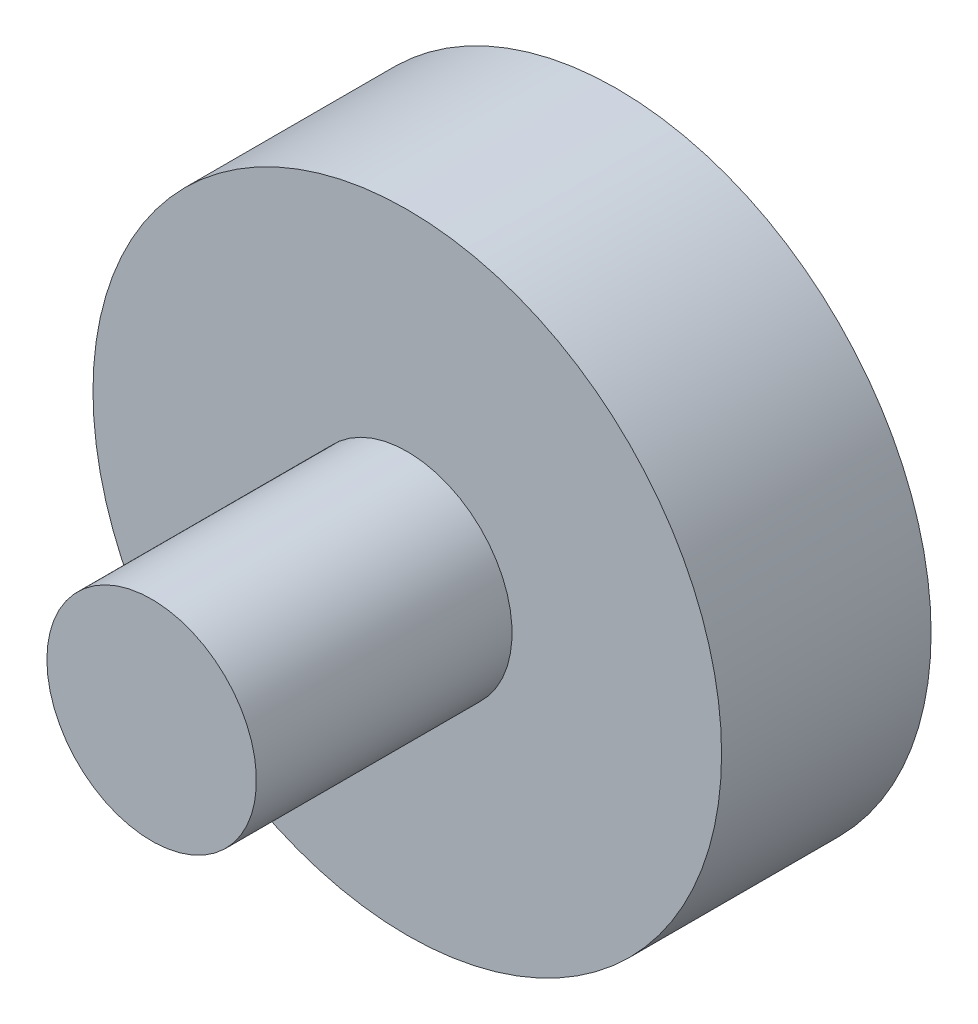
from build123d import *

# Parameters (mm, degrees)
SKETCH1_R           = 75
BOSS_EXTRUDE1_DEPTH = 50
SKETCH2_R           = 25
BOSS_EXTRUDE2_DEPTH = 61


with BuildPart() as part:
    # Sketch1 → Boss-Extrude1 (new body)
    with BuildSketch(Plane.XY):
        Circle(SKETCH1_R)
    extrude(amount=BOSS_EXTRUDE1_DEPTH)

    # Sketch2 → Boss-Extrude2 (add)
    with BuildSketch(Plane.XY.offset(50)):
        with Locations(Location((0, 0, 0), (0, 0, 180))):
            Circle(SKETCH2_R)
    extrude(amount=BOSS_EXTRUDE2_DEPTH)


solid = part.part
